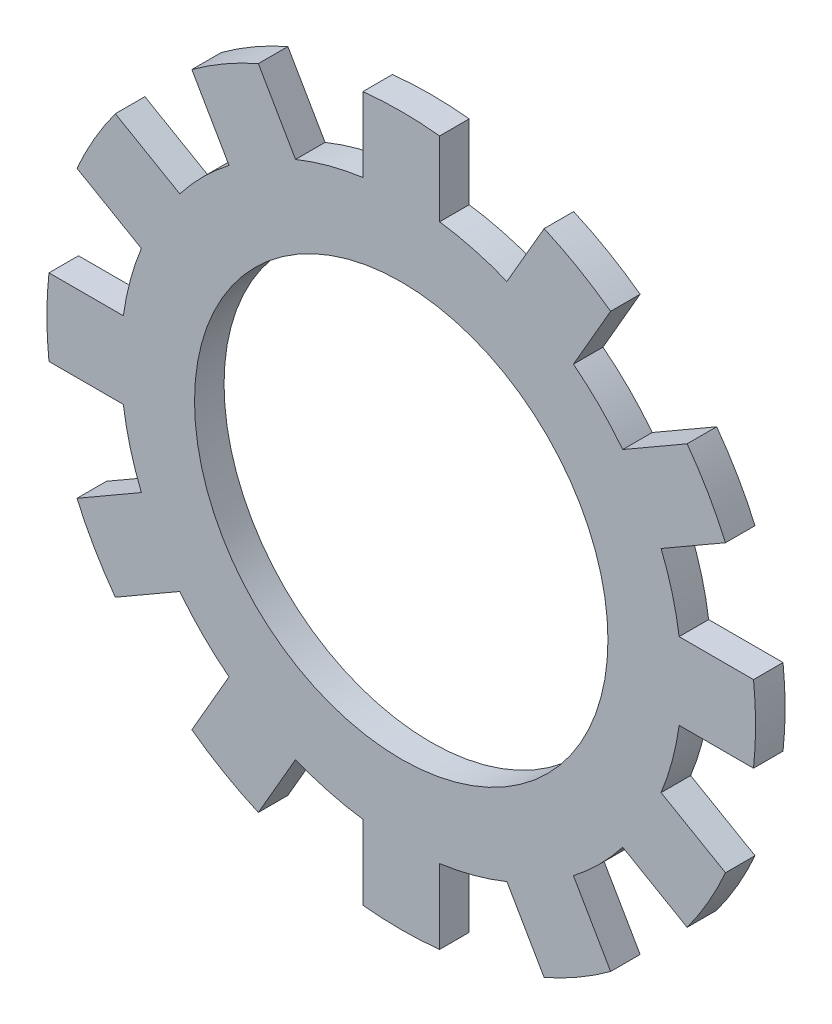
from build123d import *

# Parameters (mm, degrees)
SKETCH1_R                 = 9.5
SKETCH1_R_2               = 7
BOSS_EXTRUDE1_DEPTH       = 0.5
BOSS_EXTRUDE2_DEPTH       = 0.5
CIRPATTERN2_COUNT         = 12
CIRPATTERN2_COPY_1_DEPTH  = 0.5
CIRPATTERN2_COPY_2_DEPTH  = 0.5
CIRPATTERN2_COPY_3_DEPTH  = 0.5
CIRPATTERN2_COPY_4_DEPTH  = 0.5
CIRPATTERN2_COPY_5_DEPTH  = 0.5
CIRPATTERN2_COPY_6_DEPTH  = 0.5
CIRPATTERN2_COPY_7_DEPTH  = 0.5
CIRPATTERN2_COPY_8_DEPTH  = 0.5
CIRPATTERN2_COPY_9_DEPTH  = 0.5
CIRPATTERN2_COPY_10_DEPTH = 0.5
CIRPATTERN2_COPY_11_DEPTH = 0.5


with BuildPart() as part:
    # Sketch1 → Boss-Extrude1 (new, symmetric)
    with BuildSketch(Plane.XY):
        Circle(SKETCH1_R)
        Circle(SKETCH1_R_2, mode=Mode.SUBTRACT)
    extrude(amount=BOSS_EXTRUDE1_DEPTH, both=True)

    # Sketch3 → Boss-Extrude2 (add, symmetric)
    with BuildSketch(Plane.XY):
        with BuildLine():
            Line((-1.3, 11.929375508), (-1.3, 9.410632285))
            ThreePointArc((-1.3, 9.410632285), (-0.651534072, 9.477631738), (0, 9.5))
            Line((0, 9.5), (0, 12))
            ThreePointArc((0, 12), (-0.650958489, 11.982330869), (-1.3, 11.929375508))
        make_face()
    boss_extrude2 = extrude(amount=BOSS_EXTRUDE2_DEPTH, both=True)

    # Mirror1: Boss-Extrude2 across plane
    add(boss_extrude2.mirror(Plane(origin=(0, 0, 0), x_dir=(0, 0, 1), z_dir=(1, 0, 0))))

    # CirPattern2: Boss-Extrude2 ×12 about axis
    cirpattern2_axis = Axis((0, 0, 0), (0, 0, 1))
    for i in range(1, CIRPATTERN2_COUNT):
        add(boss_extrude2.rotate(cirpattern2_axis, i * 360 / CIRPATTERN2_COUNT))

    # CirPattern2 copy 1 sketch → CirPattern2 copy 1 (add, symmetric)
    with BuildSketch(Plane(origin=(0, 0, 0), x_dir=(-0.8660254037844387, -0.49999999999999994, 0), z_dir=(0, 0, 1))):
        with BuildLine():
            Line((-1.3, -11.929375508), (-1.3, -9.410632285))
            ThreePointArc((-1.3, -9.410632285), (-0.651534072, -9.477631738), (0, -9.5))
            Line((0, -9.5), (0, -12))
            ThreePointArc((0, -12), (-0.650958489, -11.982330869), (-1.3, -11.929375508))
        make_face()
    extrude(amount=CIRPATTERN2_COPY_1_DEPTH, both=True)

    # CirPattern2 copy 2 sketch → CirPattern2 copy 2 (add, symmetric)
    with BuildSketch(Plane(origin=(0, 0, 0), x_dir=(-0.5000000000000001, -0.8660254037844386, 0), z_dir=(0, 0, 1))):
        with BuildLine():
            Line((-1.3, -11.929375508), (-1.3, -9.410632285))
            ThreePointArc((-1.3, -9.410632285), (-0.651534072, -9.477631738), (0, -9.5))
            Line((0, -9.5), (0, -12))
            ThreePointArc((0, -12), (-0.650958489, -11.982330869), (-1.3, -11.929375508))
        make_face()
    extrude(amount=CIRPATTERN2_COPY_2_DEPTH, both=True)

    # CirPattern2 copy 3 sketch → CirPattern2 copy 3 (add, symmetric)
    with BuildSketch(Plane(origin=(0, 0, 0), x_dir=(0, -1, 0), z_dir=(0, 0, 1))):
        with BuildLine():
            Line((-1.3, -11.929375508), (-1.3, -9.410632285))
            ThreePointArc((-1.3, -9.410632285), (-0.651534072, -9.477631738), (0, -9.5))
            Line((0, -9.5), (0, -12))
            ThreePointArc((0, -12), (-0.650958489, -11.982330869), (-1.3, -11.929375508))
        make_face()
    extrude(amount=CIRPATTERN2_COPY_3_DEPTH, both=True)

    # CirPattern2 copy 4 sketch → CirPattern2 copy 4 (add, symmetric)
    with BuildSketch(Plane(origin=(0, 0, 0), x_dir=(0.4999999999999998, -0.8660254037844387, 0), z_dir=(0, 0, 1))):
        with BuildLine():
            Line((-1.3, -11.929375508), (-1.3, -9.410632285))
            ThreePointArc((-1.3, -9.410632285), (-0.651534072, -9.477631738), (0, -9.5))
            Line((0, -9.5), (0, -12))
            ThreePointArc((0, -12), (-0.650958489, -11.982330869), (-1.3, -11.929375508))
        make_face()
    extrude(amount=CIRPATTERN2_COPY_4_DEPTH, both=True)

    # CirPattern2 copy 5 sketch → CirPattern2 copy 5 (add, symmetric)
    with BuildSketch(Plane(origin=(0, 0, 0), x_dir=(0.8660254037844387, -0.49999999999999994, 0), z_dir=(0, 0, 1))):
        with BuildLine():
            Line((-1.3, -11.929375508), (-1.3, -9.410632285))
            ThreePointArc((-1.3, -9.410632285), (-0.651534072, -9.477631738), (0, -9.5))
            Line((0, -9.5), (0, -12))
            ThreePointArc((0, -12), (-0.650958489, -11.982330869), (-1.3, -11.929375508))
        make_face()
    extrude(amount=CIRPATTERN2_COPY_5_DEPTH, both=True)

    # CirPattern2 copy 6 sketch → CirPattern2 copy 6 (add, symmetric)
    with BuildSketch(Plane.XY):
        with BuildLine():
            Line((-1.3, -11.929375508), (-1.3, -9.410632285))
            ThreePointArc((-1.3, -9.410632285), (-0.651534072, -9.477631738), (0, -9.5))
            Line((0, -9.5), (0, -12))
            ThreePointArc((0, -12), (-0.650958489, -11.982330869), (-1.3, -11.929375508))
        make_face()
    extrude(amount=CIRPATTERN2_COPY_6_DEPTH, both=True)

    # CirPattern2 copy 7 sketch → CirPattern2 copy 7 (add, symmetric)
    with BuildSketch(Plane(origin=(0, 0, 0), x_dir=(0.8660254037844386, 0.5000000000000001, 0), z_dir=(0, 0, 1))):
        with BuildLine():
            Line((-1.3, -11.929375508), (-1.3, -9.410632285))
            ThreePointArc((-1.3, -9.410632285), (-0.651534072, -9.477631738), (0, -9.5))
            Line((0, -9.5), (0, -12))
            ThreePointArc((0, -12), (-0.650958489, -11.982330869), (-1.3, -11.929375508))
        make_face()
    extrude(amount=CIRPATTERN2_COPY_7_DEPTH, both=True)

    # CirPattern2 copy 8 sketch → CirPattern2 copy 8 (add, symmetric)
    with BuildSketch(Plane(origin=(0, 0, 0), x_dir=(0.5000000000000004, 0.8660254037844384, 0), z_dir=(0, 0, 1))):
        with BuildLine():
            Line((-1.3, -11.929375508), (-1.3, -9.410632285))
            ThreePointArc((-1.3, -9.410632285), (-0.651534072, -9.477631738), (0, -9.5))
            Line((0, -9.5), (0, -12))
            ThreePointArc((0, -12), (-0.650958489, -11.982330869), (-1.3, -11.929375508))
        make_face()
    extrude(amount=CIRPATTERN2_COPY_8_DEPTH, both=True)

    # CirPattern2 copy 9 sketch → CirPattern2 copy 9 (add, symmetric)
    with BuildSketch(Plane(origin=(0, 0, 0), x_dir=(0, 1, 0), z_dir=(0, 0, 1))):
        with BuildLine():
            Line((-1.3, -11.929375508), (-1.3, -9.410632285))
            ThreePointArc((-1.3, -9.410632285), (-0.651534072, -9.477631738), (0, -9.5))
            Line((0, -9.5), (0, -12))
            ThreePointArc((0, -12), (-0.650958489, -11.982330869), (-1.3, -11.929375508))
        make_face()
    extrude(amount=CIRPATTERN2_COPY_9_DEPTH, both=True)

    # CirPattern2 copy 10 sketch → CirPattern2 copy 10 (add, symmetric)
    with BuildSketch(Plane(origin=(0, 0, 0), x_dir=(-0.5000000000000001, 0.8660254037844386, 0), z_dir=(0, 0, 1))):
        with BuildLine():
            Line((-1.3, -11.929375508), (-1.3, -9.410632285))
            ThreePointArc((-1.3, -9.410632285), (-0.651534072, -9.477631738), (0, -9.5))
            Line((0, -9.5), (0, -12))
            ThreePointArc((0, -12), (-0.650958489, -11.982330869), (-1.3, -11.929375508))
        make_face()
    extrude(amount=CIRPATTERN2_COPY_10_DEPTH, both=True)

    # CirPattern2 copy 11 sketch → CirPattern2 copy 11 (add, symmetric)
    with BuildSketch(Plane(origin=(0, 0, 0), x_dir=(-0.8660254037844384, 0.5000000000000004, 0), z_dir=(0, 0, 1))):
        with BuildLine():
            Line((-1.3, -11.929375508), (-1.3, -9.410632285))
            ThreePointArc((-1.3, -9.410632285), (-0.651534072, -9.477631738), (0, -9.5))
            Line((0, -9.5), (0, -12))
            ThreePointArc((0, -12), (-0.650958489, -11.982330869), (-1.3, -11.929375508))
        make_face()
    extrude(amount=CIRPATTERN2_COPY_11_DEPTH, both=True)


solid = part.part
